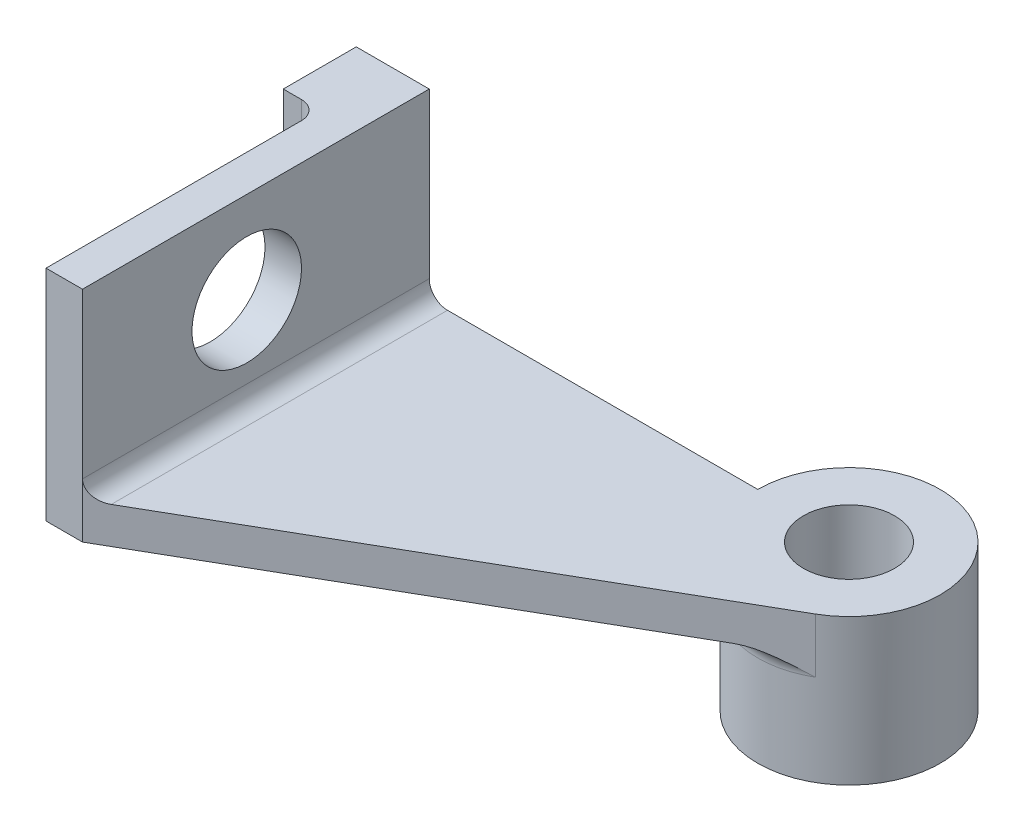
ISO-10303-21;
HEADER;
FILE_DESCRIPTION(('STEP AP214'),'2;1');
FILE_NAME('part.step','',(''),(''),'','','');
FILE_SCHEMA(('AUTOMOTIVE_DESIGN { 1 0 10303 214 1 1 1 1 }'));
ENDSEC;
DATA;
#1=APPLICATION_CONTEXT('core data for automotive mechanical design processes');
#2=APPLICATION_PROTOCOL_DEFINITION('international standard','automotive_design',2000,#1);
#3=PRODUCT_CONTEXT('',#1,'mechanical');
#4=PRODUCT('Part','Part','',(#3));
#5=PRODUCT_RELATED_PRODUCT_CATEGORY('part','',(#4));
#6=PRODUCT_DEFINITION_FORMATION('','',#4);
#7=PRODUCT_DEFINITION_CONTEXT('part definition',#1,'design');
#8=PRODUCT_DEFINITION('design','',#6,#7);
#9=PRODUCT_DEFINITION_SHAPE('','',#8);
#10=(LENGTH_UNIT() NAMED_UNIT(*) SI_UNIT(.MILLI.,.METRE.));
#11=(NAMED_UNIT(*) PLANE_ANGLE_UNIT() SI_UNIT($,.RADIAN.));
#12=(NAMED_UNIT(*) SI_UNIT($,.STERADIAN.) SOLID_ANGLE_UNIT());
#13=UNCERTAINTY_MEASURE_WITH_UNIT(LENGTH_MEASURE(1.E-05),#10,'distance_accuracy_value','');
#14=(GEOMETRIC_REPRESENTATION_CONTEXT(3) GLOBAL_UNCERTAINTY_ASSIGNED_CONTEXT((#13)) GLOBAL_UNIT_ASSIGNED_CONTEXT((#10,
#11,#12)) REPRESENTATION_CONTEXT('',''));
#15=CARTESIAN_POINT('',(0.,0.,0.));
#16=DIRECTION('',(0.,0.,1.));
#17=DIRECTION('',(1.,0.,0.));
#18=AXIS2_PLACEMENT_3D('',#15,#16,#17);
#19=CARTESIAN_POINT('',(0.,50.,0.));
#20=DIRECTION('',(-1.,0.,0.));
#21=DIRECTION('',(0.,0.,1.));
#22=AXIS2_PLACEMENT_3D('',#19,#20,#21);
#23=PLANE('',#22);
#24=CARTESIAN_POINT('',(0.,25.,-45.));
#25=DIRECTION('',(1.,0.,0.));
#26=DIRECTION('',(0.,0.,-1.));
#27=AXIS2_PLACEMENT_3D('',#24,#25,#26);
#28=CIRCLE('',#27,15.);
#29=CARTESIAN_POINT('',(0.,25.,-60.));
#30=VERTEX_POINT('',#29);
#31=EDGE_CURVE('E129',#30,#30,#28,.T.);
#32=ORIENTED_EDGE('',*,*,#31,.F.);
#33=EDGE_LOOP('',(#32));
#34=FACE_BOUND('',#33,.T.);
#35=DIRECTION('',(0.,-1.,0.));
#36=VECTOR('',#35,1.);
#37=CARTESIAN_POINT('',(0.,50.,0.));
#38=LINE('',#37,#36);
#39=CARTESIAN_POINT('',(0.,50.,0.));
#40=VERTEX_POINT('',#39);
#41=CARTESIAN_POINT('',(0.,5.,0.));
#42=VERTEX_POINT('',#41);
#43=EDGE_CURVE('E178',#40,#42,#38,.T.);
#44=ORIENTED_EDGE('',*,*,#43,.T.);
#45=DIRECTION('',(0.,0.,1.));
#46=VECTOR('',#45,1.);
#47=CARTESIAN_POINT('',(0.,5.,0.));
#48=LINE('',#47,#46);
#49=CARTESIAN_POINT('',(0.,5.,-95.));
#50=VERTEX_POINT('',#49);
#51=EDGE_CURVE('E160',#42,#50,#48,.F.);
#52=ORIENTED_EDGE('',*,*,#51,.T.);
#53=DIRECTION('',(0.,-1.,0.));
#54=VECTOR('',#53,1.);
#55=CARTESIAN_POINT('',(0.,50.,-95.));
#56=LINE('',#55,#54);
#57=CARTESIAN_POINT('',(0.,50.,-95.));
#58=VERTEX_POINT('',#57);
#59=EDGE_CURVE('E161',#58,#50,#56,.T.);
#60=ORIENTED_EDGE('',*,*,#59,.F.);
#61=DIRECTION('',(0.,0.,-1.));
#62=VECTOR('',#61,1.);
#63=CARTESIAN_POINT('',(0.,50.,0.));
#64=LINE('',#63,#62);
#65=EDGE_CURVE('E220',#40,#58,#64,.T.);
#66=ORIENTED_EDGE('',*,*,#65,.F.);
#67=EDGE_LOOP('',(#44,#52,#60,#66));
#68=FACE_BOUND('',#67,.T.);
#69=ADVANCED_FACE('F31',(#34,#68),#23,.F.);
#70=CARTESIAN_POINT('',(0.,50.,-95.));
#71=DIRECTION('',(0.,0.,1.));
#72=DIRECTION('',(1.,0.,0.));
#73=AXIS2_PLACEMENT_3D('',#70,#71,#72);
#74=PLANE('',#73);
#75=ORIENTED_EDGE('',*,*,#59,.T.);
#76=CARTESIAN_POINT('',(5.,5.,-95.));
#77=DIRECTION('',(0.,0.,1.));
#78=DIRECTION('',(1.,0.,0.));
#79=AXIS2_PLACEMENT_3D('',#76,#77,#78);
#80=CIRCLE('',#79,5.);
#81=CARTESIAN_POINT('',(5.,0.,-95.));
#82=VERTEX_POINT('',#81);
#83=EDGE_CURVE('E146',#50,#82,#80,.T.);
#84=ORIENTED_EDGE('',*,*,#83,.T.);
#85=DIRECTION('',(-1.,0.,0.));
#86=VECTOR('',#85,1.);
#87=CARTESIAN_POINT('',(0.,0.,-95.));
#88=LINE('',#87,#86);
#89=CARTESIAN_POINT('',(90.,0.,-95.));
#90=VERTEX_POINT('',#89);
#91=EDGE_CURVE('E136',#90,#82,#88,.T.);
#92=ORIENTED_EDGE('',*,*,#91,.F.);
#93=DIRECTION('',(0.,1.,0.));
#94=VECTOR('',#93,1.);
#95=CARTESIAN_POINT('',(90.,-10.,-95.));
#96=LINE('',#95,#94);
#97=CARTESIAN_POINT('',(90.,-15.,-95.));
#98=VERTEX_POINT('',#97);
#99=EDGE_CURVE('E121',#98,#90,#96,.T.);
#100=ORIENTED_EDGE('',*,*,#99,.F.);
#101=CARTESIAN_POINT('',(85.,-15.,-95.));
#102=DIRECTION('',(0.,0.,1.));
#103=DIRECTION('',(1.,0.,0.));
#104=AXIS2_PLACEMENT_3D('',#101,#102,#103);
#105=CIRCLE('',#104,5.);
#106=CARTESIAN_POINT('',(85.,-10.,-95.));
#107=VERTEX_POINT('',#106);
#108=EDGE_CURVE('E43',#98,#107,#105,.T.);
#109=ORIENTED_EDGE('',*,*,#108,.T.);
#110=DIRECTION('',(-1.,0.,0.));
#111=VECTOR('',#110,1.);
#112=CARTESIAN_POINT('',(0.,-10.,-95.));
#113=LINE('',#112,#111);
#114=CARTESIAN_POINT('',(-20.,-10.,-95.));
#115=VERTEX_POINT('',#114);
#116=EDGE_CURVE('E196',#107,#115,#113,.T.);
#117=ORIENTED_EDGE('',*,*,#116,.T.);
#118=DIRECTION('',(0.,-1.,0.));
#119=VECTOR('',#118,1.);
#120=CARTESIAN_POINT('',(-20.,50.,-95.));
#121=LINE('',#120,#119);
#122=CARTESIAN_POINT('',(-20.,50.,-95.));
#123=VERTEX_POINT('',#122);
#124=EDGE_CURVE('E182',#123,#115,#121,.T.);
#125=ORIENTED_EDGE('',*,*,#124,.F.);
#126=DIRECTION('',(-1.,0.,0.));
#127=VECTOR('',#126,1.);
#128=CARTESIAN_POINT('',(0.,50.,-95.));
#129=LINE('',#128,#127);
#130=EDGE_CURVE('E180',#58,#123,#129,.T.);
#131=ORIENTED_EDGE('',*,*,#130,.F.);
#132=EDGE_LOOP('',(#75,#84,#92,#100,#109,#117,#125,#131));
#133=FACE_BOUND('',#132,.T.);
#134=ADVANCED_FACE('F144',(#133),#74,.F.);
#135=CARTESIAN_POINT('',(-20.,50.,-95.));
#136=DIRECTION('',(1.,0.,0.));
#137=DIRECTION('',(0.,0.,-1.));
#138=AXIS2_PLACEMENT_3D('',#135,#136,#137);
#139=PLANE('',#138);
#140=ORIENTED_EDGE('',*,*,#124,.T.);
#141=DIRECTION('',(0.,0.,1.));
#142=VECTOR('',#141,1.);
#143=CARTESIAN_POINT('',(-20.,-10.,-95.));
#144=LINE('',#143,#142);
#145=CARTESIAN_POINT('',(-20.,-10.,-75.));
#146=VERTEX_POINT('',#145);
#147=EDGE_CURVE('E199',#115,#146,#144,.T.);
#148=ORIENTED_EDGE('',*,*,#147,.T.);
#149=DIRECTION('',(0.,-1.,0.));
#150=VECTOR('',#149,1.);
#151=CARTESIAN_POINT('',(-20.,50.,-75.));
#152=LINE('',#151,#150);
#153=CARTESIAN_POINT('',(-20.,50.,-75.));
#154=VERTEX_POINT('',#153);
#155=EDGE_CURVE('E185',#154,#146,#152,.T.);
#156=ORIENTED_EDGE('',*,*,#155,.F.);
#157=DIRECTION('',(0.,0.,1.));
#158=VECTOR('',#157,1.);
#159=CARTESIAN_POINT('',(-20.,50.,-95.));
#160=LINE('',#159,#158);
#161=EDGE_CURVE('E223',#123,#154,#160,.T.);
#162=ORIENTED_EDGE('',*,*,#161,.F.);
#163=EDGE_LOOP('',(#140,#148,#156,#162));
#164=FACE_BOUND('',#163,.T.);
#165=ADVANCED_FACE('F252',(#164),#139,.F.);
#166=CARTESIAN_POINT('',(-20.,50.,-75.));
#167=DIRECTION('',(0.,0.,-1.));
#168=DIRECTION('',(-1.,0.,0.));
#169=AXIS2_PLACEMENT_3D('',#166,#167,#168);
#170=PLANE('',#169);
#171=ORIENTED_EDGE('',*,*,#155,.T.);
#172=DIRECTION('',(1.,0.,0.));
#173=VECTOR('',#172,1.);
#174=CARTESIAN_POINT('',(-20.,-10.,-75.));
#175=LINE('',#174,#173);
#176=CARTESIAN_POINT('',(-15.,-10.,-75.));
#177=VERTEX_POINT('',#176);
#178=EDGE_CURVE('E209',#146,#177,#175,.T.);
#179=ORIENTED_EDGE('',*,*,#178,.T.);
#180=DIRECTION('',(0.,-1.,0.));
#181=VECTOR('',#180,1.);
#182=CARTESIAN_POINT('',(-15.,50.,-75.));
#183=LINE('',#182,#181);
#184=CARTESIAN_POINT('',(-15.,50.,-75.));
#185=VERTEX_POINT('',#184);
#186=EDGE_CURVE('E238',#185,#177,#183,.T.);
#187=ORIENTED_EDGE('',*,*,#186,.F.);
#188=DIRECTION('',(1.,0.,0.));
#189=VECTOR('',#188,1.);
#190=CARTESIAN_POINT('',(-20.,50.,-75.));
#191=LINE('',#190,#189);
#192=EDGE_CURVE('E225',#154,#185,#191,.T.);
#193=ORIENTED_EDGE('',*,*,#192,.F.);
#194=EDGE_LOOP('',(#171,#179,#187,#193));
#195=FACE_BOUND('',#194,.T.);
#196=ADVANCED_FACE('F243',(#195),#170,.F.);
#197=CARTESIAN_POINT('',(-15.,50.,-70.));
#198=DIRECTION('',(0.,-1.,0.));
#199=DIRECTION('',(0.,0.,-1.));
#200=AXIS2_PLACEMENT_3D('',#197,#198,#199);
#201=CYLINDRICAL_SURFACE('',#200,5.);
#202=ORIENTED_EDGE('',*,*,#186,.T.);
#203=CARTESIAN_POINT('',(-15.,-10.,-70.));
#204=DIRECTION('',(0.,-1.,0.));
#205=DIRECTION('',(0.,0.,-1.));
#206=AXIS2_PLACEMENT_3D('',#203,#204,#205);
#207=CIRCLE('',#206,5.);
#208=CARTESIAN_POINT('',(-10.,-10.,-70.));
#209=VERTEX_POINT('',#208);
#210=EDGE_CURVE('E212',#177,#209,#207,.T.);
#211=ORIENTED_EDGE('',*,*,#210,.T.);
#212=DIRECTION('',(0.,-1.,0.));
#213=VECTOR('',#212,1.);
#214=CARTESIAN_POINT('',(-10.,50.,-70.));
#215=LINE('',#214,#213);
#216=CARTESIAN_POINT('',(-10.,50.,-70.));
#217=VERTEX_POINT('',#216);
#218=EDGE_CURVE('E236',#217,#209,#215,.T.);
#219=ORIENTED_EDGE('',*,*,#218,.F.);
#220=CARTESIAN_POINT('',(-15.,50.,-70.));
#221=DIRECTION('',(0.,-1.,0.));
#222=DIRECTION('',(0.,0.,-1.));
#223=AXIS2_PLACEMENT_3D('',#220,#221,#222);
#224=CIRCLE('',#223,5.);
#225=EDGE_CURVE('E227',#185,#217,#224,.T.);
#226=ORIENTED_EDGE('',*,*,#225,.F.);
#227=EDGE_LOOP('',(#202,#211,#219,#226));
#228=FACE_BOUND('',#227,.T.);
#229=ADVANCED_FACE('F267',(#228),#201,.F.);
#230=CARTESIAN_POINT('',(-10.,50.,-70.));
#231=DIRECTION('',(1.,0.,0.));
#232=DIRECTION('',(0.,0.,-1.));
#233=AXIS2_PLACEMENT_3D('',#230,#231,#232);
#234=PLANE('',#233);
#235=CARTESIAN_POINT('',(-10.,25.,-45.));
#236=DIRECTION('',(1.,0.,0.));
#237=DIRECTION('',(0.,0.,-1.));
#238=AXIS2_PLACEMENT_3D('',#235,#236,#237);
#239=CIRCLE('',#238,15.);
#240=CARTESIAN_POINT('',(-10.,25.,-60.));
#241=VERTEX_POINT('',#240);
#242=EDGE_CURVE('E194',#241,#241,#239,.T.);
#243=ORIENTED_EDGE('',*,*,#242,.T.);
#244=EDGE_LOOP('',(#243));
#245=FACE_BOUND('',#244,.T.);
#246=ORIENTED_EDGE('',*,*,#218,.T.);
#247=DIRECTION('',(0.,0.,1.));
#248=VECTOR('',#247,1.);
#249=CARTESIAN_POINT('',(-10.,-10.,-70.));
#250=LINE('',#249,#248);
#251=CARTESIAN_POINT('',(-10.,-10.,0.));
#252=VERTEX_POINT('',#251);
#253=EDGE_CURVE('E215',#209,#252,#250,.T.);
#254=ORIENTED_EDGE('',*,*,#253,.T.);
#255=DIRECTION('',(0.,-1.,0.));
#256=VECTOR('',#255,1.);
#257=CARTESIAN_POINT('',(-10.,50.,0.));
#258=LINE('',#257,#256);
#259=CARTESIAN_POINT('',(-10.,50.,0.));
#260=VERTEX_POINT('',#259);
#261=EDGE_CURVE('E234',#260,#252,#258,.T.);
#262=ORIENTED_EDGE('',*,*,#261,.F.);
#263=DIRECTION('',(0.,0.,1.));
#264=VECTOR('',#263,1.);
#265=CARTESIAN_POINT('',(-10.,50.,-70.));
#266=LINE('',#265,#264);
#267=EDGE_CURVE('E229',#217,#260,#266,.T.);
#268=ORIENTED_EDGE('',*,*,#267,.F.);
#269=EDGE_LOOP('',(#246,#254,#262,#268));
#270=FACE_BOUND('',#269,.T.);
#271=ADVANCED_FACE('F263',(#245,#270),#234,.F.);
#272=CARTESIAN_POINT('',(0.,50.,0.));
#273=DIRECTION('',(0.,0.,-1.));
#274=DIRECTION('',(-1.,0.,0.));
#275=AXIS2_PLACEMENT_3D('',#272,#273,#274);
#276=PLANE('',#275);
#277=ORIENTED_EDGE('',*,*,#261,.T.);
#278=DIRECTION('',(1.,0.,0.));
#279=VECTOR('',#278,1.);
#280=CARTESIAN_POINT('',(0.,-10.,0.));
#281=LINE('',#280,#279);
#282=CARTESIAN_POINT('',(0.,-10.,0.));
#283=VERTEX_POINT('',#282);
#284=EDGE_CURVE('E218',#252,#283,#281,.T.);
#285=ORIENTED_EDGE('',*,*,#284,.T.);
#286=DIRECTION('',(0.,1.,0.));
#287=VECTOR('',#286,1.);
#288=CARTESIAN_POINT('',(0.,-10.,0.));
#289=LINE('',#288,#287);
#290=EDGE_CURVE('E50',#283,#42,#289,.T.);
#291=ORIENTED_EDGE('',*,*,#290,.T.);
#292=ORIENTED_EDGE('',*,*,#43,.F.);
#293=DIRECTION('',(1.,0.,0.));
#294=VECTOR('',#293,1.);
#295=CARTESIAN_POINT('',(0.,50.,0.));
#296=LINE('',#295,#294);
#297=EDGE_CURVE('E231',#260,#40,#296,.T.);
#298=ORIENTED_EDGE('',*,*,#297,.F.);
#299=EDGE_LOOP('',(#277,#285,#291,#292,#298));
#300=FACE_BOUND('',#299,.T.);
#301=ADVANCED_FACE('F258',(#300),#276,.F.);
#302=CARTESIAN_POINT('',(-15.,50.,-70.));
#303=DIRECTION('',(0.,-1.,0.));
#304=DIRECTION('',(0.,0.,-1.));
#305=AXIS2_PLACEMENT_3D('',#302,#303,#304);
#306=PLANE('',#305);
#307=ORIENTED_EDGE('',*,*,#65,.T.);
#308=ORIENTED_EDGE('',*,*,#130,.T.);
#309=ORIENTED_EDGE('',*,*,#161,.T.);
#310=ORIENTED_EDGE('',*,*,#192,.T.);
#311=ORIENTED_EDGE('',*,*,#225,.T.);
#312=ORIENTED_EDGE('',*,*,#267,.T.);
#313=ORIENTED_EDGE('',*,*,#297,.T.);
#314=EDGE_LOOP('',(#307,#308,#309,#310,#311,#312,#313));
#315=FACE_BOUND('',#314,.T.);
#316=ADVANCED_FACE('F269',(#315),#306,.F.);
#317=CARTESIAN_POINT('',(-15.,-10.,-70.));
#318=DIRECTION('',(0.,-1.,0.));
#319=DIRECTION('',(0.,0.,-1.));
#320=AXIS2_PLACEMENT_3D('',#317,#318,#319);
#321=PLANE('',#320);
#322=ORIENTED_EDGE('',*,*,#116,.F.);
#323=CARTESIAN_POINT('',(115.,-10.,-95.));
#324=DIRECTION('',(0.,-1.,0.));
#325=DIRECTION('',(0.,0.,-1.));
#326=AXIS2_PLACEMENT_3D('',#323,#324,#325);
#327=CIRCLE('',#326,30.);
#328=CARTESIAN_POINT('',(113.092262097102,-10.,-65.060719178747));
#329=VERTEX_POINT('',#328);
#330=EDGE_CURVE('E164',#107,#329,#327,.F.);
#331=ORIENTED_EDGE('',*,*,#330,.T.);
#332=DIRECTION('',(0.866798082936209,0.,-0.498659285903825));
#333=VECTOR('',#332,1.);
#334=CARTESIAN_POINT('',(0.,-10.,0.));
#335=LINE('',#334,#333);
#336=EDGE_CURVE('E147',#283,#329,#335,.T.);
#337=ORIENTED_EDGE('',*,*,#336,.F.);
#338=ORIENTED_EDGE('',*,*,#284,.F.);
#339=ORIENTED_EDGE('',*,*,#253,.F.);
#340=ORIENTED_EDGE('',*,*,#210,.F.);
#341=ORIENTED_EDGE('',*,*,#178,.F.);
#342=ORIENTED_EDGE('',*,*,#147,.F.);
#343=EDGE_LOOP('',(#322,#331,#337,#338,#339,#340,#341,#342));
#344=FACE_BOUND('',#343,.T.);
#345=ADVANCED_FACE('F250',(#344),#321,.T.);
#346=CARTESIAN_POINT('',(-20.,25.,-45.));
#347=DIRECTION('',(1.,0.,0.));
#348=DIRECTION('',(0.,0.,-1.));
#349=AXIS2_PLACEMENT_3D('',#346,#347,#348);
#350=CYLINDRICAL_SURFACE('',#349,15.);
#351=ORIENTED_EDGE('',*,*,#31,.T.);
#352=EDGE_LOOP('',(#351));
#353=FACE_BOUND('',#352,.T.);
#354=ORIENTED_EDGE('',*,*,#242,.F.);
#355=EDGE_LOOP('',(#354));
#356=FACE_BOUND('',#355,.T.);
#357=ADVANCED_FACE('F276',(#353,#356),#350,.F.);
#358=CARTESIAN_POINT('',(0.,-10.,0.));
#359=DIRECTION('',(0.498659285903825,0.,0.866798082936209));
#360=DIRECTION('',(0.866798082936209,0.,-0.498659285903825));
#361=AXIS2_PLACEMENT_3D('',#358,#359,#360);
#362=PLANE('',#361);
#363=DIRECTION('',(0.866798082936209,0.,-0.498659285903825));
#364=VECTOR('',#363,1.);
#365=CARTESIAN_POINT('',(0.,0.,0.));
#366=LINE('',#365,#364);
#367=CARTESIAN_POINT('',(5.,0.,-2.87644432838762));
#368=VERTEX_POINT('',#367);
#369=CARTESIAN_POINT('',(127.466482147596,0.,-73.3300479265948));
#370=VERTEX_POINT('',#369);
#371=EDGE_CURVE('E139',#368,#370,#366,.T.);
#372=ORIENTED_EDGE('',*,*,#371,.F.);
#373=CARTESIAN_POINT('',(5.,5.,-2.87644432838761));
#374=DIRECTION('',(0.498659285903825,0.,0.866798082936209));
#375=DIRECTION('',(-0.866798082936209,0.,0.498659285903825));
#376=AXIS2_PLACEMENT_3D('',#373,#374,#375);
#377=ELLIPSE('',#376,5.76835608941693,5.);
#378=EDGE_CURVE('E166',#368,#42,#377,.F.);
#379=ORIENTED_EDGE('',*,*,#378,.T.);
#380=ORIENTED_EDGE('',*,*,#290,.F.);
#381=ORIENTED_EDGE('',*,*,#336,.T.);
#382=CARTESIAN_POINT('',(113.092262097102,-10.,-65.060719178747));
#383=CARTESIAN_POINT('',(113.359569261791,-10.0000404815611,-65.2144980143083));
#384=CARTESIAN_POINT('',(113.626791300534,-10.0087151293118,-65.3682278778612));
#385=CARTESIAN_POINT('',(114.160371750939,-10.0416022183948,-65.6751907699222));
#386=CARTESIAN_POINT('',(114.426730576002,-10.0658055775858,-65.8284240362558));
#387=CARTESIAN_POINT('',(114.957449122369,-10.127935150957,-66.1337405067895));
#388=CARTESIAN_POINT('',(115.221812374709,-10.1658221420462,-66.2858257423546));
#389=CARTESIAN_POINT('',(115.74902019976,-10.2538837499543,-66.5891225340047));
#390=CARTESIAN_POINT('',(116.011864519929,-10.304060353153,-66.7403339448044));
#391=CARTESIAN_POINT('',(116.791897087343,-10.4697787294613,-67.1890779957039));
#392=CARTESIAN_POINT('',(117.306560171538,-10.6012712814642,-67.4851579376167));
#393=CARTESIAN_POINT('',(118.328670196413,-10.8984960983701,-68.0731664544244));
#394=CARTESIAN_POINT('',(118.836110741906,-11.0642569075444,-68.3650913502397));
#395=CARTESIAN_POINT('',(119.68711390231,-11.36709789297,-68.8546639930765));
#396=CARTESIAN_POINT('',(120.032600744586,-11.4970840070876,-69.053418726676));
#397=CARTESIAN_POINT('',(120.720381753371,-11.7678849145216,-69.4490914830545));
#398=CARTESIAN_POINT('',(121.062675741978,-11.9087003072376,-69.6460094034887));
#399=CARTESIAN_POINT('',(122.085130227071,-12.3445325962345,-70.2342160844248));
#400=CARTESIAN_POINT('',(122.760981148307,-12.6529789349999,-70.6230255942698));
#401=CARTESIAN_POINT('',(124.780121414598,-13.6139959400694,-71.7846145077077));
#402=CARTESIAN_POINT('',(126.110944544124,-14.3006273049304,-72.5502222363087));
#403=CARTESIAN_POINT('',(127.449800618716,-14.9913933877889,-73.3204512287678));
#404=CARTESIAN_POINT('',(127.458141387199,-14.9956967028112,-73.3252495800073));
#405=CARTESIAN_POINT('',(127.466482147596,-15.,-73.3300479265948));
#406=B_SPLINE_CURVE_WITH_KNOTS('',3,(#382,#383,#384,#385,#386,#387,#388,#389,#390,#391,#392,
#393,#394,#395,#396,#397,#398,#399,#400,#401,#402,#403,#404,#405),.UNSPECIFIED.,.F.,.F.,(4,2,2,
2,2,2,2,2,2,2,2,4),(0.,0.924891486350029,1.84924253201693,2.77096475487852,3.69283605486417,
5.5158257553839,7.34034010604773,8.59789194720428,9.85551344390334,12.3703286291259,
17.4147711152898,17.4463938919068),.UNSPECIFIED.);
#407=CARTESIAN_POINT('',(127.466482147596,-15.,-73.3300479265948));
#408=VERTEX_POINT('',#407);
#409=EDGE_CURVE('E11',#329,#408,#406,.T.);
#410=ORIENTED_EDGE('',*,*,#409,.T.);
#411=DIRECTION('',(0.,1.,0.));
#412=VECTOR('',#411,1.);
#413=CARTESIAN_POINT('',(127.466482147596,-10.,-73.3300479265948));
#414=LINE('',#413,#412);
#415=EDGE_CURVE('E130',#408,#370,#414,.T.);
#416=ORIENTED_EDGE('',*,*,#415,.T.);
#417=EDGE_LOOP('',(#372,#379,#380,#381,#410,#416));
#418=FACE_BOUND('',#417,.T.);
#419=ADVANCED_FACE('F171',(#418),#362,.T.);
#420=CARTESIAN_POINT('',(0.,0.,-95.));
#421=DIRECTION('',(0.,1.,0.));
#422=DIRECTION('',(0.,0.,1.));
#423=AXIS2_PLACEMENT_3D('',#420,#421,#422);
#424=PLANE('',#423);
#425=CARTESIAN_POINT('',(115.,0.,-95.));
#426=DIRECTION('',(0.,1.,0.));
#427=DIRECTION('',(0.,0.,1.));
#428=AXIS2_PLACEMENT_3D('',#425,#426,#427);
#429=CIRCLE('',#428,12.5);
#430=CARTESIAN_POINT('',(115.,0.,-82.5));
#431=VERTEX_POINT('',#430);
#432=EDGE_CURVE('E141',#431,#431,#429,.T.);
#433=ORIENTED_EDGE('',*,*,#432,.F.);
#434=EDGE_LOOP('',(#433));
#435=FACE_BOUND('',#434,.T.);
#436=ORIENTED_EDGE('',*,*,#91,.T.);
#437=DIRECTION('',(0.,0.,1.));
#438=VECTOR('',#437,1.);
#439=CARTESIAN_POINT('',(5.,0.,-95.));
#440=LINE('',#439,#438);
#441=EDGE_CURVE('E158',#82,#368,#440,.T.);
#442=ORIENTED_EDGE('',*,*,#441,.T.);
#443=ORIENTED_EDGE('',*,*,#371,.T.);
#444=CARTESIAN_POINT('',(115.,0.,-95.));
#445=DIRECTION('',(0.,1.,0.));
#446=DIRECTION('',(0.,0.,1.));
#447=AXIS2_PLACEMENT_3D('',#444,#445,#446);
#448=CIRCLE('',#447,25.);
#449=EDGE_CURVE('E124',#370,#90,#448,.T.);
#450=ORIENTED_EDGE('',*,*,#449,.T.);
#451=EDGE_LOOP('',(#436,#442,#443,#450));
#452=FACE_BOUND('',#451,.T.);
#453=ADVANCED_FACE('F134',(#435,#452),#424,.T.);
#454=CARTESIAN_POINT('',(115.,-40.,-95.));
#455=DIRECTION('',(0.,1.,0.));
#456=DIRECTION('',(0.,0.,1.));
#457=AXIS2_PLACEMENT_3D('',#454,#455,#456);
#458=CYLINDRICAL_SURFACE('',#457,25.);
#459=CARTESIAN_POINT('',(115.,-40.,-95.));
#460=DIRECTION('',(0.,1.,0.));
#461=DIRECTION('',(0.,0.,1.));
#462=AXIS2_PLACEMENT_3D('',#459,#460,#461);
#463=CIRCLE('',#462,25.);
#464=CARTESIAN_POINT('',(115.,-40.,-70.));
#465=VERTEX_POINT('',#464);
#466=EDGE_CURVE('E140',#465,#465,#463,.T.);
#467=ORIENTED_EDGE('',*,*,#466,.T.);
#468=EDGE_LOOP('',(#467));
#469=FACE_BOUND('',#468,.T.);
#470=CARTESIAN_POINT('',(115.,-15.,-95.));
#471=DIRECTION('',(0.,-1.,0.));
#472=DIRECTION('',(0.,0.,-1.));
#473=AXIS2_PLACEMENT_3D('',#470,#471,#472);
#474=CIRCLE('',#473,25.);
#475=EDGE_CURVE('E127',#408,#98,#474,.T.);
#476=ORIENTED_EDGE('',*,*,#475,.T.);
#477=ORIENTED_EDGE('',*,*,#99,.T.);
#478=ORIENTED_EDGE('',*,*,#449,.F.);
#479=ORIENTED_EDGE('',*,*,#415,.F.);
#480=EDGE_LOOP('',(#476,#477,#478,#479));
#481=FACE_BOUND('',#480,.T.);
#482=ADVANCED_FACE('F123',(#469,#481),#458,.T.);
#483=CARTESIAN_POINT('',(115.,-40.,-95.));
#484=DIRECTION('',(0.,1.,0.));
#485=DIRECTION('',(0.,0.,1.));
#486=AXIS2_PLACEMENT_3D('',#483,#484,#485);
#487=PLANE('',#486);
#488=CARTESIAN_POINT('',(115.,-40.,-95.));
#489=DIRECTION('',(0.,-1.,0.));
#490=DIRECTION('',(0.,0.,-1.));
#491=AXIS2_PLACEMENT_3D('',#488,#489,#490);
#492=CIRCLE('',#491,12.5);
#493=CARTESIAN_POINT('',(115.,-40.,-107.5));
#494=VERTEX_POINT('',#493);
#495=EDGE_CURVE('E425',#494,#494,#492,.T.);
#496=ORIENTED_EDGE('',*,*,#495,.F.);
#497=EDGE_LOOP('',(#496));
#498=FACE_BOUND('',#497,.T.);
#499=ORIENTED_EDGE('',*,*,#466,.F.);
#500=EDGE_LOOP('',(#499));
#501=FACE_BOUND('',#500,.T.);
#502=ADVANCED_FACE('F341',(#498,#501),#487,.F.);
#503=CARTESIAN_POINT('',(115.,50.000025,-95.));
#504=DIRECTION('',(0.,-1.,0.));
#505=DIRECTION('',(0.,0.,-1.));
#506=AXIS2_PLACEMENT_3D('',#503,#504,#505);
#507=CYLINDRICAL_SURFACE('',#506,12.5);
#508=ORIENTED_EDGE('',*,*,#432,.T.);
#509=EDGE_LOOP('',(#508));
#510=FACE_BOUND('',#509,.T.);
#511=ORIENTED_EDGE('',*,*,#495,.T.);
#512=EDGE_LOOP('',(#511));
#513=FACE_BOUND('',#512,.T.);
#514=ADVANCED_FACE('F354',(#510,#513),#507,.F.);
#515=CARTESIAN_POINT('',(5.,5.,-95.));
#516=DIRECTION('',(0.,0.,1.));
#517=DIRECTION('',(1.,0.,0.));
#518=AXIS2_PLACEMENT_3D('',#515,#516,#517);
#519=CYLINDRICAL_SURFACE('',#518,5.);
#520=ORIENTED_EDGE('',*,*,#83,.F.);
#521=ORIENTED_EDGE('',*,*,#51,.F.);
#522=ORIENTED_EDGE('',*,*,#378,.F.);
#523=ORIENTED_EDGE('',*,*,#441,.F.);
#524=EDGE_LOOP('',(#520,#521,#522,#523));
#525=FACE_BOUND('',#524,.T.);
#526=ADVANCED_FACE('F174',(#525),#519,.F.);
#527=CARTESIAN_POINT('',(115.,-15.,-95.));
#528=DIRECTION('',(0.,-1.,0.));
#529=DIRECTION('',(0.,0.,-1.));
#530=AXIS2_PLACEMENT_3D('',#527,#528,#529);
#531=TOROIDAL_SURFACE('',#530,30.,5.);
#532=ORIENTED_EDGE('',*,*,#409,.F.);
#533=ORIENTED_EDGE('',*,*,#330,.F.);
#534=ORIENTED_EDGE('',*,*,#108,.F.);
#535=ORIENTED_EDGE('',*,*,#475,.F.);
#536=EDGE_LOOP('',(#532,#533,#534,#535));
#537=FACE_BOUND('',#536,.T.);
#538=ADVANCED_FACE('F256',(#537),#531,.F.);
#539=CLOSED_SHELL('',(#69,#134,#165,#196,#229,#271,#301,#316,#345,#357,#419,#453,#482,#502,#514,
#526,#538));
#540=MANIFOLD_SOLID_BREP('B2',#539);
#541=ADVANCED_BREP_SHAPE_REPRESENTATION('',(#18,#540),#14);
#542=SHAPE_DEFINITION_REPRESENTATION(#9,#541);
ENDSEC;
END-ISO-10303-21;
